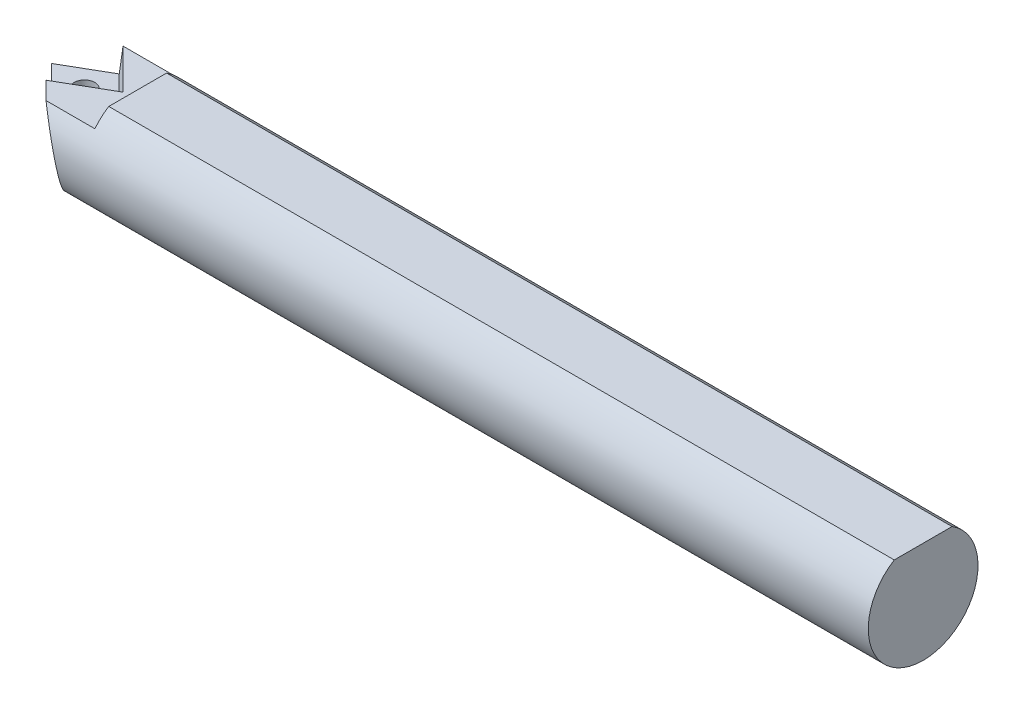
from build123d import *

# Parameters (mm, degrees)
SKETCH1_R           = 8
BOSS_EXTRUDE1_DEPTH = 65
SKETCH3_W           = 144.456226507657
SKETCH3_H           = 20.714568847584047
CUT_EXTRUDE1_DEPTH  = 68.14193920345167
CUT_EXTRUDE2_DEPTH  = 15.5
CUT_EXTRUDE3_DEPTH  = 3.18
CUT_EXTRUDE3_DRAFT  = -7.000000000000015
SKETCH9_R           = 1.500000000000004
CUT_EXTRUDE4_DEPTH  = 67.22259735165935
CUT_EXTRUDE5_DEPTH  = 67.76825605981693
CUT_EXTRUDE5_TAPER  = -10.000000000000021


with BuildPart() as part:
    # Sketch1 → Boss-Extrude1 (new, symmetric)
    with BuildSketch(Plane(origin=(0, 0, 0), x_dir=(0, 0, -1), z_dir=(1, 0, 0))):
        Circle(SKETCH1_R)
    extrude(amount=BOSS_EXTRUDE1_DEPTH, both=True)

    # Sketch3 → Cut-Extrude1 (cut, through all)
    with BuildSketch(Plane(origin=(0, 6.8, 0), x_dir=(1, 0, 0), z_dir=(0, 1, 0))):
        Rectangle(SKETCH3_W, SKETCH3_H)
    extrude(amount=CUT_EXTRUDE1_DEPTH, mode=Mode.SUBTRACT)

    # Sketch7 → Cut-Extrude2 (cut)
    with BuildSketch(Plane.ZY.offset(65)):
        Polygon((-9.592052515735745, 4.999999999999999), (9.282631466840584, 4.999999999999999), (9.282631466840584, 6.800000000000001), (-9.592052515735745, 6.8), align=None)
    extrude(amount=-CUT_EXTRUDE2_DEPTH, mode=Mode.SUBTRACT)


with BuildPart() as cut_extrude3_tool:
    # Sketch8 → Cut-Extrude3 (with draft: the straight prism first)
    with BuildSketch(Plane(origin=(0, 4.999999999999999, 0), x_dir=(1, 0, 0), z_dir=(0, 1, 0))):
        Polygon((-65, 2.1349515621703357), (-59.187516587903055, -3.6775318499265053), (-52.06870733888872, 0.43251458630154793), (-57.88119075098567, 6.244997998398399), align=None)
    extrude(amount=-CUT_EXTRUDE3_DEPTH)
    # Cut-Extrude3: the draft: its side faces are tilted about the plane it starts from
    cut_extrude3_sides = [cut_extrude3_tool.faces().sort_by_distance(p)[0] for p in [
        (-62.093758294, 3.41, 0.771290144),
        (-55.628111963, 3.41, 1.622508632),
        (-54.974949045, 3.41, -3.338756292),
        (-61.440595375, 3.41, -4.18997478),
    ]]
    draft(cut_extrude3_sides, Plane(origin=(0, 4.999999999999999, 0), x_dir=(1, 0, 0), z_dir=(0, 1, 0)), CUT_EXTRUDE3_DRAFT)


with BuildPart() as part_1:
    add(part.part)

    # Cut-Extrude3: cut by cut_extrude3_tool
    add(cut_extrude3_tool.part, mode=Mode.SUBTRACT)

    # Sketch9 → Cut-Extrude4 (cut, through all)
    with BuildSketch(Plane(origin=(0, 1.8199999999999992, 0), x_dir=(1, 0, 0), z_dir=(0, 1, 0))):
        with Locations(Location((-58.53435366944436, 1.2837330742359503, 0), (0, 0, 270))):
            Circle(SKETCH9_R)
    extrude(amount=-CUT_EXTRUDE4_DEPTH, mode=Mode.SUBTRACT)

    # Sketch10 → Cut-Extrude5 (cut, through all)
    with BuildSketch(Plane(origin=(0, 4.999999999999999, 0), x_dir=(1, 0, 0), z_dir=(0, 1, 0))):
        Polygon((-72.2998904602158, 9.434842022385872), (-65.00000000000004, 2.134951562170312), (-57.88119075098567, 6.244997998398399), (-50.693974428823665, 10.39453927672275), (-52.19037461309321, 14.875868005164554), (-72.6215062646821, 15.83326180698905), align=None)
        Polygon((-71.73743888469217, -1.754910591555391), (-65.00000000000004, 2.134951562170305), (-72.2998904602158, 9.434842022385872), align=None)
        Polygon((-49.67592731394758, -13.189121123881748), (-59.187516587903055, -3.677531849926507), (-65.00000000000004, 2.134951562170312), (-71.73743888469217, -1.754910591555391), (-71.14556837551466, -13.529941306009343), align=None)
    extrude(amount=-CUT_EXTRUDE5_DEPTH, taper=CUT_EXTRUDE5_TAPER, mode=Mode.SUBTRACT)


solid = part_1.part
